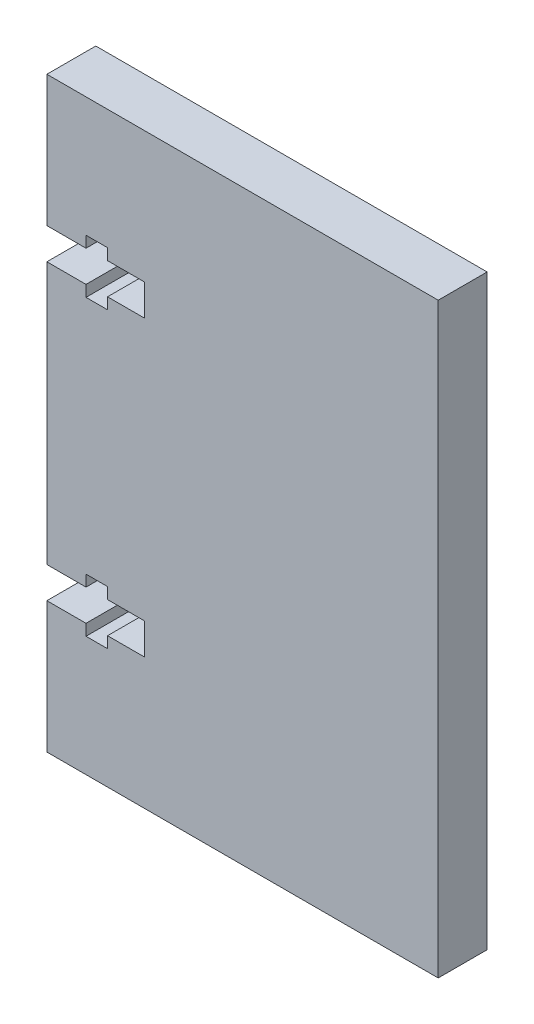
ISO-10303-21;
HEADER;
FILE_DESCRIPTION(('STEP AP214'),'2;1');
FILE_NAME('part.step','',(''),(''),'','','');
FILE_SCHEMA(('AUTOMOTIVE_DESIGN { 1 0 10303 214 1 1 1 1 }'));
ENDSEC;
DATA;
#1=APPLICATION_CONTEXT('core data for automotive mechanical design processes');
#2=APPLICATION_PROTOCOL_DEFINITION('international standard','automotive_design',2000,#1);
#3=PRODUCT_CONTEXT('',#1,'mechanical');
#4=PRODUCT('Part','Part','',(#3));
#5=PRODUCT_RELATED_PRODUCT_CATEGORY('part','',(#4));
#6=PRODUCT_DEFINITION_FORMATION('','',#4);
#7=PRODUCT_DEFINITION_CONTEXT('part definition',#1,'design');
#8=PRODUCT_DEFINITION('design','',#6,#7);
#9=PRODUCT_DEFINITION_SHAPE('','',#8);
#10=(LENGTH_UNIT() NAMED_UNIT(*) SI_UNIT(.MILLI.,.METRE.));
#11=(NAMED_UNIT(*) PLANE_ANGLE_UNIT() SI_UNIT($,.RADIAN.));
#12=(NAMED_UNIT(*) SI_UNIT($,.STERADIAN.) SOLID_ANGLE_UNIT());
#13=UNCERTAINTY_MEASURE_WITH_UNIT(LENGTH_MEASURE(1.E-05),#10,'distance_accuracy_value','');
#14=(GEOMETRIC_REPRESENTATION_CONTEXT(3) GLOBAL_UNCERTAINTY_ASSIGNED_CONTEXT((#13)) GLOBAL_UNIT_ASSIGNED_CONTEXT((#10,
#11,#12)) REPRESENTATION_CONTEXT('',''));
#15=CARTESIAN_POINT('',(0.,0.,0.));
#16=DIRECTION('',(0.,0.,1.));
#17=DIRECTION('',(1.,0.,0.));
#18=AXIS2_PLACEMENT_3D('',#15,#16,#17);
#19=CARTESIAN_POINT('',(-15.9999999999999,-13.3999999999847,10.));
#20=DIRECTION('',(-1.,0.,0.));
#21=DIRECTION('',(0.,-1.,0.));
#22=AXIS2_PLACEMENT_3D('',#19,#20,#21);
#23=PLANE('',#22);
#24=DIRECTION('',(0.,0.,1.));
#25=VECTOR('',#24,1.);
#26=CARTESIAN_POINT('',(-15.9999999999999,-13.3999999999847,10.));
#27=LINE('',#26,#25);
#28=CARTESIAN_POINT('',(-15.9999999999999,-13.3999999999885,5.));
#29=VERTEX_POINT('',#28);
#30=CARTESIAN_POINT('',(-15.9999999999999,-13.3999999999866,0.));
#31=VERTEX_POINT('',#30);
#32=EDGE_CURVE('E379',#29,#31,#27,.F.);
#33=ORIENTED_EDGE('',*,*,#32,.T.);
#34=DIRECTION('',(0.,1.,0.));
#35=VECTOR('',#34,1.);
#36=CARTESIAN_POINT('',(-15.9999999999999,0.,0.));
#37=LINE('',#36,#35);
#38=CARTESIAN_POINT('',(-15.9999999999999,-12.2499999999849,0.));
#39=VERTEX_POINT('',#38);
#40=EDGE_CURVE('E237',#31,#39,#37,.T.);
#41=ORIENTED_EDGE('',*,*,#40,.T.);
#42=DIRECTION('',(0.,0.,1.));
#43=VECTOR('',#42,1.);
#44=CARTESIAN_POINT('',(-15.9999999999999,-12.2499999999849,10.));
#45=LINE('',#44,#43);
#46=CARTESIAN_POINT('',(-15.9999999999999,-12.2499999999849,5.));
#47=VERTEX_POINT('',#46);
#48=EDGE_CURVE('E263',#39,#47,#45,.T.);
#49=ORIENTED_EDGE('',*,*,#48,.T.);
#50=DIRECTION('',(0.,-1.,0.));
#51=VECTOR('',#50,1.);
#52=CARTESIAN_POINT('',(-15.9999999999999,-13.3999999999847,5.));
#53=LINE('',#52,#51);
#54=EDGE_CURVE('E20',#29,#47,#53,.F.);
#55=ORIENTED_EDGE('',*,*,#54,.F.);
#56=EDGE_LOOP('',(#33,#41,#49,#55));
#57=FACE_BOUND('',#56,.T.);
#58=ADVANCED_FACE('F17',(#57),#23,.F.);
#59=CARTESIAN_POINT('',(-13.7999999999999,-12.2499999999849,10.));
#60=DIRECTION('',(1.,0.,0.));
#61=DIRECTION('',(0.,1.,0.));
#62=AXIS2_PLACEMENT_3D('',#59,#60,#61);
#63=PLANE('',#62);
#64=DIRECTION('',(0.,0.,1.));
#65=VECTOR('',#64,1.);
#66=CARTESIAN_POINT('',(-13.7999999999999,-12.2499999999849,10.));
#67=LINE('',#66,#65);
#68=CARTESIAN_POINT('',(-13.7999999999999,-12.2499999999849,5.));
#69=VERTEX_POINT('',#68);
#70=CARTESIAN_POINT('',(-13.7999999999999,-12.2499999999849,0.));
#71=VERTEX_POINT('',#70);
#72=EDGE_CURVE('E273',#69,#71,#67,.F.);
#73=ORIENTED_EDGE('',*,*,#72,.T.);
#74=DIRECTION('',(0.,1.,0.));
#75=VECTOR('',#74,1.);
#76=CARTESIAN_POINT('',(-13.7999999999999,0.,0.));
#77=LINE('',#76,#75);
#78=CARTESIAN_POINT('',(-13.7999999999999,-13.3999999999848,0.));
#79=VERTEX_POINT('',#78);
#80=EDGE_CURVE('E235',#71,#79,#77,.F.);
#81=ORIENTED_EDGE('',*,*,#80,.T.);
#82=DIRECTION('',(0.,0.,1.));
#83=VECTOR('',#82,1.);
#84=CARTESIAN_POINT('',(-13.7999999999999,-13.3999999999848,10.));
#85=LINE('',#84,#83);
#86=CARTESIAN_POINT('',(-13.7999999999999,-13.3999999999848,5.));
#87=VERTEX_POINT('',#86);
#88=EDGE_CURVE('E369',#79,#87,#85,.T.);
#89=ORIENTED_EDGE('',*,*,#88,.T.);
#90=DIRECTION('',(0.,1.,0.));
#91=VECTOR('',#90,1.);
#92=CARTESIAN_POINT('',(-13.7999999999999,-12.2499999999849,5.));
#93=LINE('',#92,#91);
#94=EDGE_CURVE('E247',#69,#87,#93,.F.);
#95=ORIENTED_EDGE('',*,*,#94,.F.);
#96=EDGE_LOOP('',(#73,#81,#89,#95));
#97=FACE_BOUND('',#96,.T.);
#98=ADVANCED_FACE('F514',(#97),#63,.F.);
#99=CARTESIAN_POINT('',(-13.7999999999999,-16.5999999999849,10.));
#100=DIRECTION('',(1.,0.,0.));
#101=DIRECTION('',(0.,0.,-1.));
#102=AXIS2_PLACEMENT_3D('',#99,#100,#101);
#103=PLANE('',#102);
#104=DIRECTION('',(0.,0.,-1.));
#105=VECTOR('',#104,1.);
#106=CARTESIAN_POINT('',(-13.7999999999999,-16.5999999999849,10.));
#107=LINE('',#106,#105);
#108=CARTESIAN_POINT('',(-13.7999999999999,-16.5999999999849,5.));
#109=VERTEX_POINT('',#108);
#110=CARTESIAN_POINT('',(-13.7999999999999,-16.5999999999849,0.));
#111=VERTEX_POINT('',#110);
#112=EDGE_CURVE('E363',#109,#111,#107,.T.);
#113=ORIENTED_EDGE('',*,*,#112,.T.);
#114=DIRECTION('',(0.,1.,0.));
#115=VECTOR('',#114,1.);
#116=CARTESIAN_POINT('',(-13.7999999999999,0.,0.));
#117=LINE('',#116,#115);
#118=CARTESIAN_POINT('',(-13.7999999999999,-17.7499999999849,0.));
#119=VERTEX_POINT('',#118);
#120=EDGE_CURVE('E233',#111,#119,#117,.F.);
#121=ORIENTED_EDGE('',*,*,#120,.T.);
#122=DIRECTION('',(0.,0.,1.));
#123=VECTOR('',#122,1.);
#124=CARTESIAN_POINT('',(-13.7999999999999,-17.7499999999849,10.));
#125=LINE('',#124,#123);
#126=CARTESIAN_POINT('',(-13.7999999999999,-17.7499999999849,5.));
#127=VERTEX_POINT('',#126);
#128=EDGE_CURVE('E351',#119,#127,#125,.T.);
#129=ORIENTED_EDGE('',*,*,#128,.T.);
#130=DIRECTION('',(0.,1.,0.));
#131=VECTOR('',#130,1.);
#132=CARTESIAN_POINT('',(-13.7999999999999,-16.5999999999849,5.));
#133=LINE('',#132,#131);
#134=EDGE_CURVE('E246',#109,#127,#133,.F.);
#135=ORIENTED_EDGE('',*,*,#134,.F.);
#136=EDGE_LOOP('',(#113,#121,#129,#135));
#137=FACE_BOUND('',#136,.T.);
#138=ADVANCED_FACE('F496',(#137),#103,.F.);
#139=CARTESIAN_POINT('',(-15.9999999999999,-17.7499999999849,10.));
#140=DIRECTION('',(-1.,0.,0.));
#141=DIRECTION('',(0.,0.,1.));
#142=AXIS2_PLACEMENT_3D('',#139,#140,#141);
#143=PLANE('',#142);
#144=DIRECTION('',(0.,0.,1.));
#145=VECTOR('',#144,1.);
#146=CARTESIAN_POINT('',(-15.9999999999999,-17.7499999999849,10.));
#147=LINE('',#146,#145);
#148=CARTESIAN_POINT('',(-15.9999999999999,-17.7499999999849,5.));
#149=VERTEX_POINT('',#148);
#150=CARTESIAN_POINT('',(-15.9999999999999,-17.7499999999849,0.));
#151=VERTEX_POINT('',#150);
#152=EDGE_CURVE('E357',#149,#151,#147,.F.);
#153=ORIENTED_EDGE('',*,*,#152,.T.);
#154=DIRECTION('',(0.,1.,0.));
#155=VECTOR('',#154,1.);
#156=CARTESIAN_POINT('',(-15.9999999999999,0.,0.));
#157=LINE('',#156,#155);
#158=CARTESIAN_POINT('',(-15.9999999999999,-16.599999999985,0.));
#159=VERTEX_POINT('',#158);
#160=EDGE_CURVE('E231',#151,#159,#157,.T.);
#161=ORIENTED_EDGE('',*,*,#160,.T.);
#162=DIRECTION('',(0.,0.,1.));
#163=VECTOR('',#162,1.);
#164=CARTESIAN_POINT('',(-15.9999999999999,-16.599999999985,10.));
#165=LINE('',#164,#163);
#166=CARTESIAN_POINT('',(-15.9999999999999,-16.599999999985,5.));
#167=VERTEX_POINT('',#166);
#168=EDGE_CURVE('E345',#159,#167,#165,.T.);
#169=ORIENTED_EDGE('',*,*,#168,.T.);
#170=DIRECTION('',(0.,1.,0.));
#171=VECTOR('',#170,1.);
#172=CARTESIAN_POINT('',(-15.9999999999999,-17.7499999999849,5.));
#173=LINE('',#172,#171);
#174=EDGE_CURVE('E244',#149,#167,#173,.T.);
#175=ORIENTED_EDGE('',*,*,#174,.F.);
#176=EDGE_LOOP('',(#153,#161,#169,#175));
#177=FACE_BOUND('',#176,.T.);
#178=ADVANCED_FACE('F504',(#177),#143,.F.);
#179=CARTESIAN_POINT('',(-16.0000000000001,16.5999999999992,10.));
#180=DIRECTION('',(-1.,0.,0.));
#181=DIRECTION('',(0.,-1.,0.));
#182=AXIS2_PLACEMENT_3D('',#179,#180,#181);
#183=PLANE('',#182);
#184=DIRECTION('',(0.,0.,1.));
#185=VECTOR('',#184,1.);
#186=CARTESIAN_POINT('',(-16.0000000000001,16.5999999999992,10.));
#187=LINE('',#186,#185);
#188=CARTESIAN_POINT('',(-16.0000000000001,16.5999999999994,5.));
#189=VERTEX_POINT('',#188);
#190=CARTESIAN_POINT('',(-16.0000000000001,16.5999999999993,0.));
#191=VERTEX_POINT('',#190);
#192=EDGE_CURVE('E319',#189,#191,#187,.F.);
#193=ORIENTED_EDGE('',*,*,#192,.T.);
#194=DIRECTION('',(0.,1.,0.));
#195=VECTOR('',#194,1.);
#196=CARTESIAN_POINT('',(-16.0000000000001,0.,0.));
#197=LINE('',#196,#195);
#198=CARTESIAN_POINT('',(-16.0000000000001,17.7499999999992,0.));
#199=VERTEX_POINT('',#198);
#200=EDGE_CURVE('E229',#191,#199,#197,.T.);
#201=ORIENTED_EDGE('',*,*,#200,.T.);
#202=DIRECTION('',(0.,0.,1.));
#203=VECTOR('',#202,1.);
#204=CARTESIAN_POINT('',(-16.0000000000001,17.7499999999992,10.));
#205=LINE('',#204,#203);
#206=CARTESIAN_POINT('',(-16.0000000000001,17.7499999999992,5.));
#207=VERTEX_POINT('',#206);
#208=EDGE_CURVE('E307',#199,#207,#205,.T.);
#209=ORIENTED_EDGE('',*,*,#208,.T.);
#210=DIRECTION('',(0.,-1.,0.));
#211=VECTOR('',#210,1.);
#212=CARTESIAN_POINT('',(-16.0000000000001,16.5999999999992,5.));
#213=LINE('',#212,#211);
#214=EDGE_CURVE('E242',#189,#207,#213,.F.);
#215=ORIENTED_EDGE('',*,*,#214,.F.);
#216=EDGE_LOOP('',(#193,#201,#209,#215));
#217=FACE_BOUND('',#216,.T.);
#218=ADVANCED_FACE('F424',(#217),#183,.F.);
#219=CARTESIAN_POINT('',(-13.8000000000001,17.7499999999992,10.));
#220=DIRECTION('',(1.,0.,0.));
#221=DIRECTION('',(0.,1.,0.));
#222=AXIS2_PLACEMENT_3D('',#219,#220,#221);
#223=PLANE('',#222);
#224=DIRECTION('',(0.,0.,1.));
#225=VECTOR('',#224,1.);
#226=CARTESIAN_POINT('',(-13.8000000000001,17.7499999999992,10.));
#227=LINE('',#226,#225);
#228=CARTESIAN_POINT('',(-13.8000000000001,17.7499999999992,5.));
#229=VERTEX_POINT('',#228);
#230=CARTESIAN_POINT('',(-13.8000000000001,17.7499999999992,0.));
#231=VERTEX_POINT('',#230);
#232=EDGE_CURVE('E313',#229,#231,#227,.F.);
#233=ORIENTED_EDGE('',*,*,#232,.T.);
#234=DIRECTION('',(0.,1.,0.));
#235=VECTOR('',#234,1.);
#236=CARTESIAN_POINT('',(-13.8000000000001,0.,0.));
#237=LINE('',#236,#235);
#238=CARTESIAN_POINT('',(-13.8000000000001,16.5999999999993,0.));
#239=VERTEX_POINT('',#238);
#240=EDGE_CURVE('E210',#231,#239,#237,.F.);
#241=ORIENTED_EDGE('',*,*,#240,.T.);
#242=DIRECTION('',(0.,0.,1.));
#243=VECTOR('',#242,1.);
#244=CARTESIAN_POINT('',(-13.8000000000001,16.5999999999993,10.));
#245=LINE('',#244,#243);
#246=CARTESIAN_POINT('',(-13.8000000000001,16.5999999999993,5.));
#247=VERTEX_POINT('',#246);
#248=EDGE_CURVE('E301',#239,#247,#245,.T.);
#249=ORIENTED_EDGE('',*,*,#248,.T.);
#250=DIRECTION('',(0.,1.,0.));
#251=VECTOR('',#250,1.);
#252=CARTESIAN_POINT('',(-13.8000000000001,17.7499999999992,5.));
#253=LINE('',#252,#251);
#254=EDGE_CURVE('E240',#229,#247,#253,.F.);
#255=ORIENTED_EDGE('',*,*,#254,.F.);
#256=EDGE_LOOP('',(#233,#241,#249,#255));
#257=FACE_BOUND('',#256,.T.);
#258=ADVANCED_FACE('F512',(#257),#223,.F.);
#259=CARTESIAN_POINT('',(-16.0000000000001,12.2499999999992,10.));
#260=DIRECTION('',(-1.,0.,0.));
#261=DIRECTION('',(0.,0.,1.));
#262=AXIS2_PLACEMENT_3D('',#259,#260,#261);
#263=PLANE('',#262);
#264=DIRECTION('',(0.,0.,-1.));
#265=VECTOR('',#264,1.);
#266=CARTESIAN_POINT('',(-16.0000000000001,12.2499999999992,10.));
#267=LINE('',#266,#265);
#268=CARTESIAN_POINT('',(-16.0000000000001,12.2499999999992,5.));
#269=VERTEX_POINT('',#268);
#270=CARTESIAN_POINT('',(-16.0000000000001,12.2499999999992,0.));
#271=VERTEX_POINT('',#270);
#272=EDGE_CURVE('E207',#269,#271,#267,.T.);
#273=ORIENTED_EDGE('',*,*,#272,.T.);
#274=DIRECTION('',(0.,1.,0.));
#275=VECTOR('',#274,1.);
#276=CARTESIAN_POINT('',(-16.0000000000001,0.,0.));
#277=LINE('',#276,#275);
#278=CARTESIAN_POINT('',(-16.0000000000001,13.3999999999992,0.));
#279=VERTEX_POINT('',#278);
#280=EDGE_CURVE('E202',#271,#279,#277,.T.);
#281=ORIENTED_EDGE('',*,*,#280,.T.);
#282=DIRECTION('',(0.,0.,1.));
#283=VECTOR('',#282,1.);
#284=CARTESIAN_POINT('',(-16.0000000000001,13.3999999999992,10.));
#285=LINE('',#284,#283);
#286=CARTESIAN_POINT('',(-16.0000000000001,13.3999999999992,5.));
#287=VERTEX_POINT('',#286);
#288=EDGE_CURVE('E205',#279,#287,#285,.T.);
#289=ORIENTED_EDGE('',*,*,#288,.T.);
#290=DIRECTION('',(0.,1.,0.));
#291=VECTOR('',#290,1.);
#292=CARTESIAN_POINT('',(-16.0000000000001,12.2499999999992,5.));
#293=LINE('',#292,#291);
#294=EDGE_CURVE('E35',#269,#287,#293,.T.);
#295=ORIENTED_EDGE('',*,*,#294,.F.);
#296=EDGE_LOOP('',(#273,#281,#289,#295));
#297=FACE_BOUND('',#296,.T.);
#298=ADVANCED_FACE('F203',(#297),#263,.F.);
#299=CARTESIAN_POINT('',(0.,0.,0.));
#300=DIRECTION('',(0.,0.,1.));
#301=DIRECTION('',(1.,0.,0.));
#302=AXIS2_PLACEMENT_3D('',#299,#300,#301);
#303=PLANE('',#302);
#304=DIRECTION('',(1.,-1.59594559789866E-13,0.));
#305=VECTOR('',#304,1.);
#306=CARTESIAN_POINT('',(-16.0000000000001,13.3999999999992,0.));
#307=LINE('',#306,#305);
#308=CARTESIAN_POINT('',(-20.,13.3999999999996,0.));
#309=VERTEX_POINT('',#308);
#310=EDGE_CURVE('E212',#309,#279,#307,.T.);
#311=ORIENTED_EDGE('',*,*,#310,.T.);
#312=ORIENTED_EDGE('',*,*,#280,.F.);
#313=DIRECTION('',(1.,0.,0.));
#314=VECTOR('',#313,1.);
#315=CARTESIAN_POINT('',(-13.8000000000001,12.2499999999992,0.));
#316=LINE('',#315,#314);
#317=CARTESIAN_POINT('',(-13.8000000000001,12.2499999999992,0.));
#318=VERTEX_POINT('',#317);
#319=EDGE_CURVE('E287',#271,#318,#316,.T.);
#320=ORIENTED_EDGE('',*,*,#319,.T.);
#321=DIRECTION('',(0.,1.,0.));
#322=VECTOR('',#321,1.);
#323=CARTESIAN_POINT('',(-13.8000000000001,13.3999999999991,0.));
#324=LINE('',#323,#322);
#325=CARTESIAN_POINT('',(-13.8000000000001,13.3999999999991,0.));
#326=VERTEX_POINT('',#325);
#327=EDGE_CURVE('E209',#318,#326,#324,.T.);
#328=ORIENTED_EDGE('',*,*,#327,.T.);
#329=DIRECTION('',(1.,0.,0.));
#330=VECTOR('',#329,1.);
#331=CARTESIAN_POINT('',(-9.99999999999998,13.3999999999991,0.));
#332=LINE('',#331,#330);
#333=CARTESIAN_POINT('',(-9.99999999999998,13.3999999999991,0.));
#334=VERTEX_POINT('',#333);
#335=EDGE_CURVE('E292',#326,#334,#332,.T.);
#336=ORIENTED_EDGE('',*,*,#335,.T.);
#337=DIRECTION('',(0.,1.,0.));
#338=VECTOR('',#337,1.);
#339=CARTESIAN_POINT('',(-9.99999999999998,16.5999999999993,0.));
#340=LINE('',#339,#338);
#341=CARTESIAN_POINT('',(-9.99999999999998,16.5999999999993,0.));
#342=VERTEX_POINT('',#341);
#343=EDGE_CURVE('E299',#334,#342,#340,.T.);
#344=ORIENTED_EDGE('',*,*,#343,.T.);
#345=DIRECTION('',(1.,0.,0.));
#346=VECTOR('',#345,1.);
#347=CARTESIAN_POINT('',(-13.8000000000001,16.5999999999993,0.));
#348=LINE('',#347,#346);
#349=EDGE_CURVE('E304',#342,#239,#348,.F.);
#350=ORIENTED_EDGE('',*,*,#349,.T.);
#351=ORIENTED_EDGE('',*,*,#240,.F.);
#352=DIRECTION('',(-1.,0.,0.));
#353=VECTOR('',#352,1.);
#354=CARTESIAN_POINT('',(-16.0000000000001,17.7499999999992,0.));
#355=LINE('',#354,#353);
#356=EDGE_CURVE('E310',#231,#199,#355,.T.);
#357=ORIENTED_EDGE('',*,*,#356,.T.);
#358=ORIENTED_EDGE('',*,*,#200,.F.);
#359=DIRECTION('',(-1.,2.18575157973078E-13,0.));
#360=VECTOR('',#359,1.);
#361=CARTESIAN_POINT('',(-20.0000000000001,16.6000000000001,0.));
#362=LINE('',#361,#360);
#363=CARTESIAN_POINT('',(-20.,16.5999999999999,0.));
#364=VERTEX_POINT('',#363);
#365=EDGE_CURVE('E317',#191,#364,#362,.T.);
#366=ORIENTED_EDGE('',*,*,#365,.T.);
#367=DIRECTION('',(0.,1.,0.));
#368=VECTOR('',#367,1.);
#369=CARTESIAN_POINT('',(-20.,30.,0.));
#370=LINE('',#369,#368);
#371=CARTESIAN_POINT('',(-20.,30.,0.));
#372=VERTEX_POINT('',#371);
#373=EDGE_CURVE('E321',#364,#372,#370,.T.);
#374=ORIENTED_EDGE('',*,*,#373,.T.);
#375=DIRECTION('',(1.,0.,0.));
#376=VECTOR('',#375,1.);
#377=CARTESIAN_POINT('',(-20.,30.,0.));
#378=LINE('',#377,#376);
#379=CARTESIAN_POINT('',(20.,30.,0.));
#380=VERTEX_POINT('',#379);
#381=EDGE_CURVE('E326',#372,#380,#378,.T.);
#382=ORIENTED_EDGE('',*,*,#381,.T.);
#383=DIRECTION('',(0.,-1.,0.));
#384=VECTOR('',#383,1.);
#385=CARTESIAN_POINT('',(20.,30.,0.));
#386=LINE('',#385,#384);
#387=CARTESIAN_POINT('',(20.,-30.,0.));
#388=VERTEX_POINT('',#387);
#389=EDGE_CURVE('E331',#380,#388,#386,.T.);
#390=ORIENTED_EDGE('',*,*,#389,.T.);
#391=DIRECTION('',(1.,0.,0.));
#392=VECTOR('',#391,1.);
#393=CARTESIAN_POINT('',(-20.,-30.,0.));
#394=LINE('',#393,#392);
#395=CARTESIAN_POINT('',(-20.,-30.,0.));
#396=VERTEX_POINT('',#395);
#397=EDGE_CURVE('E336',#388,#396,#394,.F.);
#398=ORIENTED_EDGE('',*,*,#397,.T.);
#399=DIRECTION('',(0.,1.,0.));
#400=VECTOR('',#399,1.);
#401=CARTESIAN_POINT('',(-20.,30.,0.));
#402=LINE('',#401,#400);
#403=CARTESIAN_POINT('',(-19.9999999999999,-16.5999999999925,0.));
#404=VERTEX_POINT('',#403);
#405=EDGE_CURVE('E343',#396,#404,#402,.T.);
#406=ORIENTED_EDGE('',*,*,#405,.T.);
#407=DIRECTION('',(1.,3.78950343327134E-12,0.));
#408=VECTOR('',#407,1.);
#409=CARTESIAN_POINT('',(-15.9999999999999,-16.599999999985,0.));
#410=LINE('',#409,#408);
#411=EDGE_CURVE('E348',#404,#159,#410,.T.);
#412=ORIENTED_EDGE('',*,*,#411,.T.);
#413=ORIENTED_EDGE('',*,*,#160,.F.);
#414=DIRECTION('',(1.,0.,0.));
#415=VECTOR('',#414,1.);
#416=CARTESIAN_POINT('',(-13.7999999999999,-17.7499999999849,0.));
#417=LINE('',#416,#415);
#418=EDGE_CURVE('E354',#151,#119,#417,.T.);
#419=ORIENTED_EDGE('',*,*,#418,.T.);
#420=ORIENTED_EDGE('',*,*,#120,.F.);
#421=DIRECTION('',(1.,0.,0.));
#422=VECTOR('',#421,1.);
#423=CARTESIAN_POINT('',(-9.99999999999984,-16.5999999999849,0.));
#424=LINE('',#423,#422);
#425=CARTESIAN_POINT('',(-9.99999999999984,-16.5999999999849,0.));
#426=VERTEX_POINT('',#425);
#427=EDGE_CURVE('E361',#111,#426,#424,.T.);
#428=ORIENTED_EDGE('',*,*,#427,.T.);
#429=DIRECTION('',(0.,1.,0.));
#430=VECTOR('',#429,1.);
#431=CARTESIAN_POINT('',(-9.99999999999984,-13.3999999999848,0.));
#432=LINE('',#431,#430);
#433=CARTESIAN_POINT('',(-9.99999999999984,-13.3999999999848,0.));
#434=VERTEX_POINT('',#433);
#435=EDGE_CURVE('E367',#426,#434,#432,.T.);
#436=ORIENTED_EDGE('',*,*,#435,.T.);
#437=DIRECTION('',(1.,0.,0.));
#438=VECTOR('',#437,1.);
#439=CARTESIAN_POINT('',(-13.7999999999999,-13.3999999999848,0.));
#440=LINE('',#439,#438);
#441=EDGE_CURVE('E268',#434,#79,#440,.F.);
#442=ORIENTED_EDGE('',*,*,#441,.T.);
#443=ORIENTED_EDGE('',*,*,#80,.F.);
#444=DIRECTION('',(-1.,0.,0.));
#445=VECTOR('',#444,1.);
#446=CARTESIAN_POINT('',(-15.9999999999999,-12.2499999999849,0.));
#447=LINE('',#446,#445);
#448=EDGE_CURVE('E269',#71,#39,#447,.T.);
#449=ORIENTED_EDGE('',*,*,#448,.T.);
#450=ORIENTED_EDGE('',*,*,#40,.F.);
#451=DIRECTION('',(-1.,-3.79167183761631E-12,0.));
#452=VECTOR('',#451,1.);
#453=CARTESIAN_POINT('',(-19.9999999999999,-13.3999999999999,0.));
#454=LINE('',#453,#452);
#455=CARTESIAN_POINT('',(-20.,-13.3999999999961,0.));
#456=VERTEX_POINT('',#455);
#457=EDGE_CURVE('E377',#31,#456,#454,.T.);
#458=ORIENTED_EDGE('',*,*,#457,.T.);
#459=DIRECTION('',(0.,1.,0.));
#460=VECTOR('',#459,1.);
#461=CARTESIAN_POINT('',(-20.,30.,0.));
#462=LINE('',#461,#460);
#463=EDGE_CURVE('E198',#456,#309,#462,.T.);
#464=ORIENTED_EDGE('',*,*,#463,.T.);
#465=EDGE_LOOP('',(#311,#312,#320,#328,#336,#344,#350,#351,#357,#358,#366,#374,#382,#390,#398,
#406,#412,#413,#419,#420,#428,#436,#442,#443,#449,#450,#458,#464));
#466=FACE_BOUND('',#465,.T.);
#467=ADVANCED_FACE('F213',(#466),#303,.F.);
#468=CARTESIAN_POINT('',(-13.8000000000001,13.3999999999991,10.));
#469=DIRECTION('',(1.,0.,0.));
#470=DIRECTION('',(0.,0.,-1.));
#471=AXIS2_PLACEMENT_3D('',#468,#469,#470);
#472=PLANE('',#471);
#473=DIRECTION('',(0.,0.,-1.));
#474=VECTOR('',#473,1.);
#475=CARTESIAN_POINT('',(-13.8000000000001,13.3999999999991,10.));
#476=LINE('',#475,#474);
#477=CARTESIAN_POINT('',(-13.8000000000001,13.3999999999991,5.));
#478=VERTEX_POINT('',#477);
#479=EDGE_CURVE('E294',#478,#326,#476,.T.);
#480=ORIENTED_EDGE('',*,*,#479,.T.);
#481=ORIENTED_EDGE('',*,*,#327,.F.);
#482=DIRECTION('',(0.,0.,-1.));
#483=VECTOR('',#482,1.);
#484=CARTESIAN_POINT('',(-13.8000000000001,12.2499999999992,10.));
#485=LINE('',#484,#483);
#486=CARTESIAN_POINT('',(-13.8000000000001,12.2499999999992,5.));
#487=VERTEX_POINT('',#486);
#488=EDGE_CURVE('E284',#318,#487,#485,.F.);
#489=ORIENTED_EDGE('',*,*,#488,.T.);
#490=DIRECTION('',(0.,1.,0.));
#491=VECTOR('',#490,1.);
#492=CARTESIAN_POINT('',(-13.8000000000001,13.3999999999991,5.));
#493=LINE('',#492,#491);
#494=EDGE_CURVE('E216',#478,#487,#493,.F.);
#495=ORIENTED_EDGE('',*,*,#494,.F.);
#496=EDGE_LOOP('',(#480,#481,#489,#495));
#497=FACE_BOUND('',#496,.T.);
#498=ADVANCED_FACE('F391',(#497),#472,.F.);
#499=CARTESIAN_POINT('',(-16.0000000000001,13.3999999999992,10.));
#500=DIRECTION('',(-1.59594559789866E-13,-1.,0.));
#501=DIRECTION('',(1.,-1.59594559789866E-13,0.));
#502=AXIS2_PLACEMENT_3D('',#499,#500,#501);
#503=PLANE('',#502);
#504=ORIENTED_EDGE('',*,*,#288,.F.);
#505=ORIENTED_EDGE('',*,*,#310,.F.);
#506=DIRECTION('',(0.,0.,1.));
#507=VECTOR('',#506,1.);
#508=CARTESIAN_POINT('',(-20.,13.3999999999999,5.));
#509=LINE('',#508,#507);
#510=CARTESIAN_POINT('',(-20.,13.3999999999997,5.));
#511=VERTEX_POINT('',#510);
#512=EDGE_CURVE('E222',#309,#511,#509,.T.);
#513=ORIENTED_EDGE('',*,*,#512,.T.);
#514=DIRECTION('',(1.,0.,0.));
#515=VECTOR('',#514,1.);
#516=CARTESIAN_POINT('',(0.,13.3999999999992,5.));
#517=LINE('',#516,#515);
#518=EDGE_CURVE('E220',#287,#511,#517,.F.);
#519=ORIENTED_EDGE('',*,*,#518,.F.);
#520=EDGE_LOOP('',(#504,#505,#513,#519));
#521=FACE_BOUND('',#520,.T.);
#522=ADVANCED_FACE('F218',(#521),#503,.F.);
#523=CARTESIAN_POINT('',(-20.,30.,5.));
#524=DIRECTION('',(1.,0.,0.));
#525=DIRECTION('',(0.,1.,0.));
#526=AXIS2_PLACEMENT_3D('',#523,#524,#525);
#527=PLANE('',#526);
#528=ORIENTED_EDGE('',*,*,#512,.F.);
#529=ORIENTED_EDGE('',*,*,#463,.F.);
#530=DIRECTION('',(0.,0.,1.));
#531=VECTOR('',#530,1.);
#532=CARTESIAN_POINT('',(-20.,-13.3999999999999,10.));
#533=LINE('',#532,#531);
#534=CARTESIAN_POINT('',(-20.,-13.3999999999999,5.));
#535=VERTEX_POINT('',#534);
#536=EDGE_CURVE('E375',#456,#535,#533,.T.);
#537=ORIENTED_EDGE('',*,*,#536,.T.);
#538=DIRECTION('',(0.,1.,0.));
#539=VECTOR('',#538,1.);
#540=CARTESIAN_POINT('',(-20.0000000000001,0.,5.));
#541=LINE('',#540,#539);
#542=EDGE_CURVE('E278',#511,#535,#541,.F.);
#543=ORIENTED_EDGE('',*,*,#542,.F.);
#544=EDGE_LOOP('',(#528,#529,#537,#543));
#545=FACE_BOUND('',#544,.T.);
#546=ADVANCED_FACE('F382',(#545),#527,.F.);
#547=CARTESIAN_POINT('',(-19.9999999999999,-13.3999999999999,10.));
#548=DIRECTION('',(-3.79167183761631E-12,1.,0.));
#549=DIRECTION('',(-1.,-3.79167183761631E-12,0.));
#550=AXIS2_PLACEMENT_3D('',#547,#548,#549);
#551=PLANE('',#550);
#552=ORIENTED_EDGE('',*,*,#536,.F.);
#553=ORIENTED_EDGE('',*,*,#457,.F.);
#554=ORIENTED_EDGE('',*,*,#32,.F.);
#555=DIRECTION('',(1.,0.,0.));
#556=VECTOR('',#555,1.);
#557=CARTESIAN_POINT('',(0.,-13.3999999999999,5.));
#558=LINE('',#557,#556);
#559=EDGE_CURVE('E259',#535,#29,#558,.T.);
#560=ORIENTED_EDGE('',*,*,#559,.F.);
#561=EDGE_LOOP('',(#552,#553,#554,#560));
#562=FACE_BOUND('',#561,.T.);
#563=ADVANCED_FACE('F557',(#562),#551,.F.);
#564=CARTESIAN_POINT('',(-15.9999999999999,-12.2499999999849,10.));
#565=DIRECTION('',(0.,1.,0.));
#566=DIRECTION('',(-1.,0.,0.));
#567=AXIS2_PLACEMENT_3D('',#564,#565,#566);
#568=PLANE('',#567);
#569=ORIENTED_EDGE('',*,*,#48,.F.);
#570=ORIENTED_EDGE('',*,*,#448,.F.);
#571=ORIENTED_EDGE('',*,*,#72,.F.);
#572=DIRECTION('',(1.,0.,0.));
#573=VECTOR('',#572,1.);
#574=CARTESIAN_POINT('',(0.,-12.2499999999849,5.));
#575=LINE('',#574,#573);
#576=EDGE_CURVE('E256',#47,#69,#575,.T.);
#577=ORIENTED_EDGE('',*,*,#576,.F.);
#578=EDGE_LOOP('',(#569,#570,#571,#577));
#579=FACE_BOUND('',#578,.T.);
#580=ADVANCED_FACE('F272',(#579),#568,.F.);
#581=CARTESIAN_POINT('',(-13.7999999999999,-13.3999999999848,10.));
#582=DIRECTION('',(0.,1.,0.));
#583=DIRECTION('',(0.,0.,1.));
#584=AXIS2_PLACEMENT_3D('',#581,#582,#583);
#585=PLANE('',#584);
#586=ORIENTED_EDGE('',*,*,#88,.F.);
#587=ORIENTED_EDGE('',*,*,#441,.F.);
#588=DIRECTION('',(0.,0.,1.));
#589=VECTOR('',#588,1.);
#590=CARTESIAN_POINT('',(-9.99999999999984,-13.3999999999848,10.));
#591=LINE('',#590,#589);
#592=CARTESIAN_POINT('',(-9.99999999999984,-13.3999999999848,5.));
#593=VERTEX_POINT('',#592);
#594=EDGE_CURVE('E365',#434,#593,#591,.T.);
#595=ORIENTED_EDGE('',*,*,#594,.T.);
#596=DIRECTION('',(1.,0.,0.));
#597=VECTOR('',#596,1.);
#598=CARTESIAN_POINT('',(0.,-13.3999999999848,5.));
#599=LINE('',#598,#597);
#600=EDGE_CURVE('E274',#87,#593,#599,.T.);
#601=ORIENTED_EDGE('',*,*,#600,.F.);
#602=EDGE_LOOP('',(#586,#587,#595,#601));
#603=FACE_BOUND('',#602,.T.);
#604=ADVANCED_FACE('F551',(#603),#585,.F.);
#605=CARTESIAN_POINT('',(-9.99999999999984,-13.3999999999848,10.));
#606=DIRECTION('',(1.,0.,0.));
#607=DIRECTION('',(0.,1.,0.));
#608=AXIS2_PLACEMENT_3D('',#605,#606,#607);
#609=PLANE('',#608);
#610=ORIENTED_EDGE('',*,*,#594,.F.);
#611=ORIENTED_EDGE('',*,*,#435,.F.);
#612=DIRECTION('',(0.,0.,-1.));
#613=VECTOR('',#612,1.);
#614=CARTESIAN_POINT('',(-9.99999999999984,-16.5999999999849,10.));
#615=LINE('',#614,#613);
#616=CARTESIAN_POINT('',(-9.99999999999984,-16.5999999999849,5.));
#617=VERTEX_POINT('',#616);
#618=EDGE_CURVE('E359',#426,#617,#615,.F.);
#619=ORIENTED_EDGE('',*,*,#618,.T.);
#620=DIRECTION('',(0.,1.,0.));
#621=VECTOR('',#620,1.);
#622=CARTESIAN_POINT('',(-9.99999999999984,0.,5.));
#623=LINE('',#622,#621);
#624=EDGE_CURVE('E276',#593,#617,#623,.F.);
#625=ORIENTED_EDGE('',*,*,#624,.F.);
#626=EDGE_LOOP('',(#610,#611,#619,#625));
#627=FACE_BOUND('',#626,.T.);
#628=ADVANCED_FACE('F487',(#627),#609,.F.);
#629=CARTESIAN_POINT('',(-9.99999999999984,-16.5999999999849,10.));
#630=DIRECTION('',(0.,-1.,0.));
#631=DIRECTION('',(0.,0.,-1.));
#632=AXIS2_PLACEMENT_3D('',#629,#630,#631);
#633=PLANE('',#632);
#634=ORIENTED_EDGE('',*,*,#618,.F.);
#635=ORIENTED_EDGE('',*,*,#427,.F.);
#636=ORIENTED_EDGE('',*,*,#112,.F.);
#637=DIRECTION('',(1.,0.,0.));
#638=VECTOR('',#637,1.);
#639=CARTESIAN_POINT('',(0.,-16.5999999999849,5.));
#640=LINE('',#639,#638);
#641=EDGE_CURVE('E476',#617,#109,#640,.F.);
#642=ORIENTED_EDGE('',*,*,#641,.F.);
#643=EDGE_LOOP('',(#634,#635,#636,#642));
#644=FACE_BOUND('',#643,.T.);
#645=ADVANCED_FACE('F493',(#644),#633,.F.);
#646=CARTESIAN_POINT('',(-13.7999999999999,-17.7499999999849,10.));
#647=DIRECTION('',(0.,-1.,0.));
#648=DIRECTION('',(1.,0.,0.));
#649=AXIS2_PLACEMENT_3D('',#646,#647,#648);
#650=PLANE('',#649);
#651=ORIENTED_EDGE('',*,*,#128,.F.);
#652=ORIENTED_EDGE('',*,*,#418,.F.);
#653=ORIENTED_EDGE('',*,*,#152,.F.);
#654=DIRECTION('',(1.,0.,0.));
#655=VECTOR('',#654,1.);
#656=CARTESIAN_POINT('',(0.,-17.7499999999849,5.));
#657=LINE('',#656,#655);
#658=EDGE_CURVE('E474',#127,#149,#657,.F.);
#659=ORIENTED_EDGE('',*,*,#658,.F.);
#660=EDGE_LOOP('',(#651,#652,#653,#659));
#661=FACE_BOUND('',#660,.T.);
#662=ADVANCED_FACE('F502',(#661),#650,.F.);
#663=CARTESIAN_POINT('',(-15.9999999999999,-16.599999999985,10.));
#664=DIRECTION('',(3.78950343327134E-12,-1.,0.));
#665=DIRECTION('',(1.,3.78950343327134E-12,0.));
#666=AXIS2_PLACEMENT_3D('',#663,#664,#665);
#667=PLANE('',#666);
#668=ORIENTED_EDGE('',*,*,#168,.F.);
#669=ORIENTED_EDGE('',*,*,#411,.F.);
#670=DIRECTION('',(0.,0.,1.));
#671=VECTOR('',#670,1.);
#672=CARTESIAN_POINT('',(-20.,-16.6000000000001,5.));
#673=LINE('',#672,#671);
#674=CARTESIAN_POINT('',(-19.9999999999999,-16.5999999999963,5.));
#675=VERTEX_POINT('',#674);
#676=EDGE_CURVE('E341',#404,#675,#673,.T.);
#677=ORIENTED_EDGE('',*,*,#676,.T.);
#678=DIRECTION('',(1.,0.,0.));
#679=VECTOR('',#678,1.);
#680=CARTESIAN_POINT('',(0.,-16.599999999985,5.));
#681=LINE('',#680,#679);
#682=EDGE_CURVE('E471',#167,#675,#681,.F.);
#683=ORIENTED_EDGE('',*,*,#682,.F.);
#684=EDGE_LOOP('',(#668,#669,#677,#683));
#685=FACE_BOUND('',#684,.T.);
#686=ADVANCED_FACE('F465',(#685),#667,.F.);
#687=CARTESIAN_POINT('',(-20.,30.,5.));
#688=DIRECTION('',(1.,0.,0.));
#689=DIRECTION('',(0.,1.,0.));
#690=AXIS2_PLACEMENT_3D('',#687,#688,#689);
#691=PLANE('',#690);
#692=ORIENTED_EDGE('',*,*,#676,.F.);
#693=ORIENTED_EDGE('',*,*,#405,.F.);
#694=DIRECTION('',(0.,0.,1.));
#695=VECTOR('',#694,1.);
#696=CARTESIAN_POINT('',(-20.,-30.,5.));
#697=LINE('',#696,#695);
#698=CARTESIAN_POINT('',(-20.,-30.,5.));
#699=VERTEX_POINT('',#698);
#700=EDGE_CURVE('E339',#396,#699,#697,.T.);
#701=ORIENTED_EDGE('',*,*,#700,.T.);
#702=DIRECTION('',(0.,1.,0.));
#703=VECTOR('',#702,1.);
#704=CARTESIAN_POINT('',(-19.9999999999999,0.,5.));
#705=LINE('',#704,#703);
#706=EDGE_CURVE('E469',#675,#699,#705,.F.);
#707=ORIENTED_EDGE('',*,*,#706,.F.);
#708=EDGE_LOOP('',(#692,#693,#701,#707));
#709=FACE_BOUND('',#708,.T.);
#710=ADVANCED_FACE('F468',(#709),#691,.F.);
#711=CARTESIAN_POINT('',(-20.,-30.,5.));
#712=DIRECTION('',(0.,1.,0.));
#713=DIRECTION('',(0.,0.,1.));
#714=AXIS2_PLACEMENT_3D('',#711,#712,#713);
#715=PLANE('',#714);
#716=DIRECTION('',(0.,0.,1.));
#717=VECTOR('',#716,1.);
#718=CARTESIAN_POINT('',(20.,-30.,5.));
#719=LINE('',#718,#717);
#720=CARTESIAN_POINT('',(20.,-30.,5.));
#721=VERTEX_POINT('',#720);
#722=EDGE_CURVE('E334',#388,#721,#719,.T.);
#723=ORIENTED_EDGE('',*,*,#722,.T.);
#724=DIRECTION('',(1.,0.,0.));
#725=VECTOR('',#724,1.);
#726=CARTESIAN_POINT('',(0.,-30.,5.));
#727=LINE('',#726,#725);
#728=EDGE_CURVE('E457',#699,#721,#727,.T.);
#729=ORIENTED_EDGE('',*,*,#728,.F.);
#730=ORIENTED_EDGE('',*,*,#700,.F.);
#731=ORIENTED_EDGE('',*,*,#397,.F.);
#732=EDGE_LOOP('',(#723,#729,#730,#731));
#733=FACE_BOUND('',#732,.T.);
#734=ADVANCED_FACE('F455',(#733),#715,.F.);
#735=CARTESIAN_POINT('',(20.,30.,5.));
#736=DIRECTION('',(-1.,0.,0.));
#737=DIRECTION('',(0.,-1.,0.));
#738=AXIS2_PLACEMENT_3D('',#735,#736,#737);
#739=PLANE('',#738);
#740=DIRECTION('',(0.,0.,1.));
#741=VECTOR('',#740,1.);
#742=CARTESIAN_POINT('',(20.,30.,5.));
#743=LINE('',#742,#741);
#744=CARTESIAN_POINT('',(20.,30.,5.));
#745=VERTEX_POINT('',#744);
#746=EDGE_CURVE('E329',#380,#745,#743,.T.);
#747=ORIENTED_EDGE('',*,*,#746,.T.);
#748=DIRECTION('',(0.,1.,0.));
#749=VECTOR('',#748,1.);
#750=CARTESIAN_POINT('',(20.,0.,5.));
#751=LINE('',#750,#749);
#752=EDGE_CURVE('E451',#721,#745,#751,.T.);
#753=ORIENTED_EDGE('',*,*,#752,.F.);
#754=ORIENTED_EDGE('',*,*,#722,.F.);
#755=ORIENTED_EDGE('',*,*,#389,.F.);
#756=EDGE_LOOP('',(#747,#753,#754,#755));
#757=FACE_BOUND('',#756,.T.);
#758=ADVANCED_FACE('F450',(#757),#739,.F.);
#759=CARTESIAN_POINT('',(-20.,30.,5.));
#760=DIRECTION('',(0.,-1.,0.));
#761=DIRECTION('',(1.,0.,0.));
#762=AXIS2_PLACEMENT_3D('',#759,#760,#761);
#763=PLANE('',#762);
#764=DIRECTION('',(0.,0.,1.));
#765=VECTOR('',#764,1.);
#766=CARTESIAN_POINT('',(-20.,30.,5.));
#767=LINE('',#766,#765);
#768=CARTESIAN_POINT('',(-20.,30.,5.));
#769=VERTEX_POINT('',#768);
#770=EDGE_CURVE('E324',#372,#769,#767,.T.);
#771=ORIENTED_EDGE('',*,*,#770,.T.);
#772=DIRECTION('',(1.,0.,0.));
#773=VECTOR('',#772,1.);
#774=CARTESIAN_POINT('',(0.,30.,5.));
#775=LINE('',#774,#773);
#776=EDGE_CURVE('E446',#745,#769,#775,.F.);
#777=ORIENTED_EDGE('',*,*,#776,.F.);
#778=ORIENTED_EDGE('',*,*,#746,.F.);
#779=ORIENTED_EDGE('',*,*,#381,.F.);
#780=EDGE_LOOP('',(#771,#777,#778,#779));
#781=FACE_BOUND('',#780,.T.);
#782=ADVANCED_FACE('F445',(#781),#763,.F.);
#783=CARTESIAN_POINT('',(-20.,30.,5.));
#784=DIRECTION('',(1.,0.,0.));
#785=DIRECTION('',(0.,1.,0.));
#786=AXIS2_PLACEMENT_3D('',#783,#784,#785);
#787=PLANE('',#786);
#788=DIRECTION('',(0.,0.,1.));
#789=VECTOR('',#788,1.);
#790=CARTESIAN_POINT('',(-20.,16.6000000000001,10.));
#791=LINE('',#790,#789);
#792=CARTESIAN_POINT('',(-20.,16.6000000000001,5.));
#793=VERTEX_POINT('',#792);
#794=EDGE_CURVE('E315',#364,#793,#791,.T.);
#795=ORIENTED_EDGE('',*,*,#794,.T.);
#796=DIRECTION('',(0.,1.,0.));
#797=VECTOR('',#796,1.);
#798=CARTESIAN_POINT('',(-20.,0.,5.));
#799=LINE('',#798,#797);
#800=EDGE_CURVE('E439',#769,#793,#799,.F.);
#801=ORIENTED_EDGE('',*,*,#800,.F.);
#802=ORIENTED_EDGE('',*,*,#770,.F.);
#803=ORIENTED_EDGE('',*,*,#373,.F.);
#804=EDGE_LOOP('',(#795,#801,#802,#803));
#805=FACE_BOUND('',#804,.T.);
#806=ADVANCED_FACE('F437',(#805),#787,.F.);
#807=CARTESIAN_POINT('',(-20.0000000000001,16.6000000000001,10.));
#808=DIRECTION('',(2.18575157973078E-13,1.,0.));
#809=DIRECTION('',(-1.,2.18575157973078E-13,0.));
#810=AXIS2_PLACEMENT_3D('',#807,#808,#809);
#811=PLANE('',#810);
#812=ORIENTED_EDGE('',*,*,#794,.F.);
#813=ORIENTED_EDGE('',*,*,#365,.F.);
#814=ORIENTED_EDGE('',*,*,#192,.F.);
#815=DIRECTION('',(1.,0.,0.));
#816=VECTOR('',#815,1.);
#817=CARTESIAN_POINT('',(0.,16.6000000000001,5.));
#818=LINE('',#817,#816);
#819=EDGE_CURVE('E433',#793,#189,#818,.T.);
#820=ORIENTED_EDGE('',*,*,#819,.F.);
#821=EDGE_LOOP('',(#812,#813,#814,#820));
#822=FACE_BOUND('',#821,.T.);
#823=ADVANCED_FACE('F430',(#822),#811,.F.);
#824=CARTESIAN_POINT('',(-16.0000000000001,17.7499999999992,10.));
#825=DIRECTION('',(0.,1.,0.));
#826=DIRECTION('',(-1.,0.,0.));
#827=AXIS2_PLACEMENT_3D('',#824,#825,#826);
#828=PLANE('',#827);
#829=ORIENTED_EDGE('',*,*,#208,.F.);
#830=ORIENTED_EDGE('',*,*,#356,.F.);
#831=ORIENTED_EDGE('',*,*,#232,.F.);
#832=DIRECTION('',(1.,0.,0.));
#833=VECTOR('',#832,1.);
#834=CARTESIAN_POINT('',(0.,17.7499999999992,5.));
#835=LINE('',#834,#833);
#836=EDGE_CURVE('E422',#207,#229,#835,.T.);
#837=ORIENTED_EDGE('',*,*,#836,.F.);
#838=EDGE_LOOP('',(#829,#830,#831,#837));
#839=FACE_BOUND('',#838,.T.);
#840=ADVANCED_FACE('F419',(#839),#828,.F.);
#841=CARTESIAN_POINT('',(-13.8000000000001,16.5999999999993,10.));
#842=DIRECTION('',(0.,1.,0.));
#843=DIRECTION('',(0.,0.,1.));
#844=AXIS2_PLACEMENT_3D('',#841,#842,#843);
#845=PLANE('',#844);
#846=ORIENTED_EDGE('',*,*,#248,.F.);
#847=ORIENTED_EDGE('',*,*,#349,.F.);
#848=DIRECTION('',(0.,0.,-1.));
#849=VECTOR('',#848,1.);
#850=CARTESIAN_POINT('',(-9.99999999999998,16.5999999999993,10.));
#851=LINE('',#850,#849);
#852=CARTESIAN_POINT('',(-9.99999999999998,16.5999999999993,5.));
#853=VERTEX_POINT('',#852);
#854=EDGE_CURVE('E297',#342,#853,#851,.F.);
#855=ORIENTED_EDGE('',*,*,#854,.T.);
#856=DIRECTION('',(1.,0.,0.));
#857=VECTOR('',#856,1.);
#858=CARTESIAN_POINT('',(0.,16.5999999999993,5.));
#859=LINE('',#858,#857);
#860=EDGE_CURVE('E411',#247,#853,#859,.T.);
#861=ORIENTED_EDGE('',*,*,#860,.F.);
#862=EDGE_LOOP('',(#846,#847,#855,#861));
#863=FACE_BOUND('',#862,.T.);
#864=ADVANCED_FACE('F410',(#863),#845,.F.);
#865=CARTESIAN_POINT('',(-9.99999999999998,16.5999999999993,10.));
#866=DIRECTION('',(1.,0.,0.));
#867=DIRECTION('',(0.,0.,-1.));
#868=AXIS2_PLACEMENT_3D('',#865,#866,#867);
#869=PLANE('',#868);
#870=ORIENTED_EDGE('',*,*,#854,.F.);
#871=ORIENTED_EDGE('',*,*,#343,.F.);
#872=DIRECTION('',(0.,0.,-1.));
#873=VECTOR('',#872,1.);
#874=CARTESIAN_POINT('',(-9.99999999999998,13.3999999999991,10.));
#875=LINE('',#874,#873);
#876=CARTESIAN_POINT('',(-9.99999999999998,13.3999999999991,5.));
#877=VERTEX_POINT('',#876);
#878=EDGE_CURVE('E290',#334,#877,#875,.F.);
#879=ORIENTED_EDGE('',*,*,#878,.T.);
#880=DIRECTION('',(0.,1.,0.));
#881=VECTOR('',#880,1.);
#882=CARTESIAN_POINT('',(-9.99999999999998,0.,5.));
#883=LINE('',#882,#881);
#884=EDGE_CURVE('E405',#853,#877,#883,.F.);
#885=ORIENTED_EDGE('',*,*,#884,.F.);
#886=EDGE_LOOP('',(#870,#871,#879,#885));
#887=FACE_BOUND('',#886,.T.);
#888=ADVANCED_FACE('F402',(#887),#869,.F.);
#889=CARTESIAN_POINT('',(-9.99999999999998,13.3999999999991,10.));
#890=DIRECTION('',(0.,-1.,0.));
#891=DIRECTION('',(0.,0.,-1.));
#892=AXIS2_PLACEMENT_3D('',#889,#890,#891);
#893=PLANE('',#892);
#894=ORIENTED_EDGE('',*,*,#878,.F.);
#895=ORIENTED_EDGE('',*,*,#335,.F.);
#896=ORIENTED_EDGE('',*,*,#479,.F.);
#897=DIRECTION('',(1.,0.,0.));
#898=VECTOR('',#897,1.);
#899=CARTESIAN_POINT('',(0.,13.3999999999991,5.));
#900=LINE('',#899,#898);
#901=EDGE_CURVE('E26',#877,#478,#900,.F.);
#902=ORIENTED_EDGE('',*,*,#901,.F.);
#903=EDGE_LOOP('',(#894,#895,#896,#902));
#904=FACE_BOUND('',#903,.T.);
#905=ADVANCED_FACE('F397',(#904),#893,.F.);
#906=CARTESIAN_POINT('',(-13.8000000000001,12.2499999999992,10.));
#907=DIRECTION('',(0.,-1.,0.));
#908=DIRECTION('',(0.,0.,-1.));
#909=AXIS2_PLACEMENT_3D('',#906,#907,#908);
#910=PLANE('',#909);
#911=ORIENTED_EDGE('',*,*,#488,.F.);
#912=ORIENTED_EDGE('',*,*,#319,.F.);
#913=ORIENTED_EDGE('',*,*,#272,.F.);
#914=DIRECTION('',(1.,0.,0.));
#915=VECTOR('',#914,1.);
#916=CARTESIAN_POINT('',(0.,12.2499999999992,5.));
#917=LINE('',#916,#915);
#918=EDGE_CURVE('E11',#487,#269,#917,.F.);
#919=ORIENTED_EDGE('',*,*,#918,.F.);
#920=EDGE_LOOP('',(#911,#912,#913,#919));
#921=FACE_BOUND('',#920,.T.);
#922=ADVANCED_FACE('F388',(#921),#910,.F.);
#923=CARTESIAN_POINT('',(0.,0.,5.));
#924=DIRECTION('',(0.,0.,1.));
#925=DIRECTION('',(1.,0.,0.));
#926=AXIS2_PLACEMENT_3D('',#923,#924,#925);
#927=PLANE('',#926);
#928=ORIENTED_EDGE('',*,*,#918,.T.);
#929=ORIENTED_EDGE('',*,*,#294,.T.);
#930=ORIENTED_EDGE('',*,*,#518,.T.);
#931=ORIENTED_EDGE('',*,*,#542,.T.);
#932=ORIENTED_EDGE('',*,*,#559,.T.);
#933=ORIENTED_EDGE('',*,*,#54,.T.);
#934=ORIENTED_EDGE('',*,*,#576,.T.);
#935=ORIENTED_EDGE('',*,*,#94,.T.);
#936=ORIENTED_EDGE('',*,*,#600,.T.);
#937=ORIENTED_EDGE('',*,*,#624,.T.);
#938=ORIENTED_EDGE('',*,*,#641,.T.);
#939=ORIENTED_EDGE('',*,*,#134,.T.);
#940=ORIENTED_EDGE('',*,*,#658,.T.);
#941=ORIENTED_EDGE('',*,*,#174,.T.);
#942=ORIENTED_EDGE('',*,*,#682,.T.);
#943=ORIENTED_EDGE('',*,*,#706,.T.);
#944=ORIENTED_EDGE('',*,*,#728,.T.);
#945=ORIENTED_EDGE('',*,*,#752,.T.);
#946=ORIENTED_EDGE('',*,*,#776,.T.);
#947=ORIENTED_EDGE('',*,*,#800,.T.);
#948=ORIENTED_EDGE('',*,*,#819,.T.);
#949=ORIENTED_EDGE('',*,*,#214,.T.);
#950=ORIENTED_EDGE('',*,*,#836,.T.);
#951=ORIENTED_EDGE('',*,*,#254,.T.);
#952=ORIENTED_EDGE('',*,*,#860,.T.);
#953=ORIENTED_EDGE('',*,*,#884,.T.);
#954=ORIENTED_EDGE('',*,*,#901,.T.);
#955=ORIENTED_EDGE('',*,*,#494,.T.);
#956=EDGE_LOOP('',(#928,#929,#930,#931,#932,#933,#934,#935,#936,#937,#938,#939,#940,#941,#942,
#943,#944,#945,#946,#947,#948,#949,#950,#951,#952,#953,#954,#955));
#957=FACE_BOUND('',#956,.T.);
#958=ADVANCED_FACE('F254',(#957),#927,.T.);
#959=CLOSED_SHELL('',(#58,#98,#138,#178,#218,#258,#298,#467,#498,#522,#546,#563,#580,#604,#628,
#645,#662,#686,#710,#734,#758,#782,#806,#823,#840,#864,#888,#905,#922,#958));
#960=MANIFOLD_SOLID_BREP('B1',#959);
#961=ADVANCED_BREP_SHAPE_REPRESENTATION('',(#18,#960),#14);
#962=SHAPE_DEFINITION_REPRESENTATION(#9,#961);
ENDSEC;
END-ISO-10303-21;
